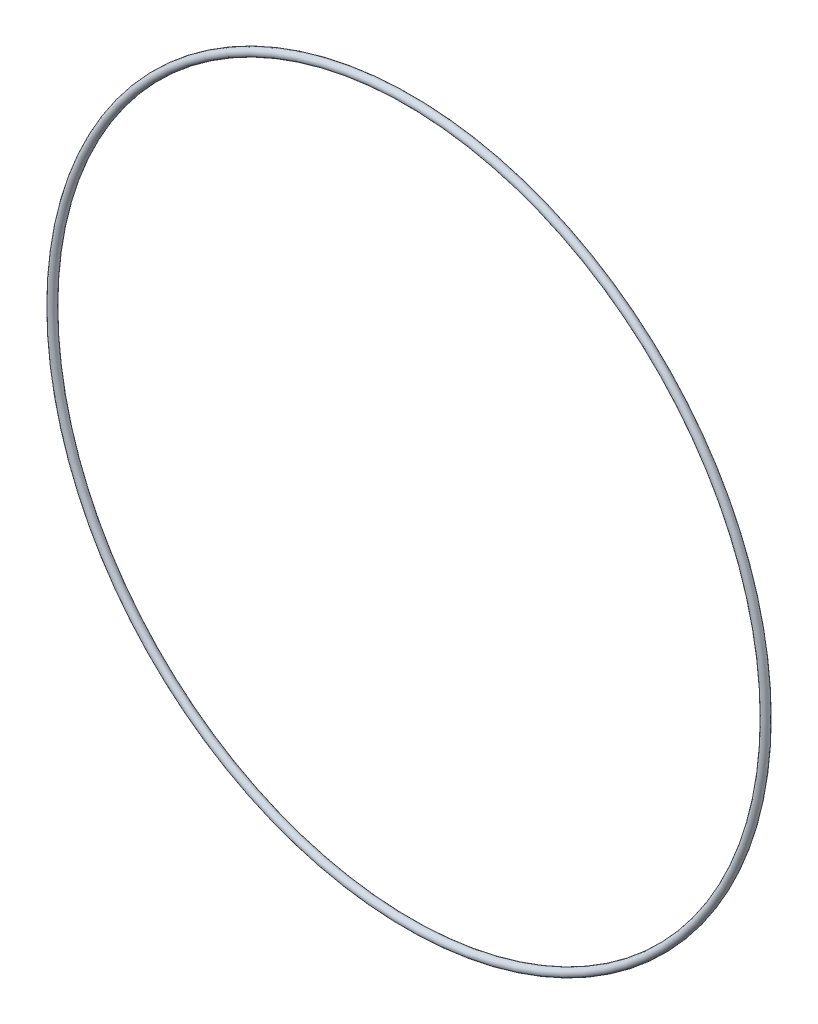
from build123d import *

# Parameters (mm, degrees)
SKETCH1_R = 2.667


with BuildPart() as part:
    # Sketch1 → Revolve1 (revolve)
    with BuildSketch(Plane(origin=(0, 0, 0), x_dir=(0, -1, 0), z_dir=(1, 0, 0)), mode=Mode.PRIVATE) as revolve1_sk:
        with Locations((243.3955, 0)):
            Circle(SKETCH1_R)
    revolve(revolve1_sk.sketch.rotate(Axis((0, 0, 2.667), (0, 0, -1)), 270), axis=Axis((0, 0, 2.667), (0, 0, -1)))


solid = part.part
